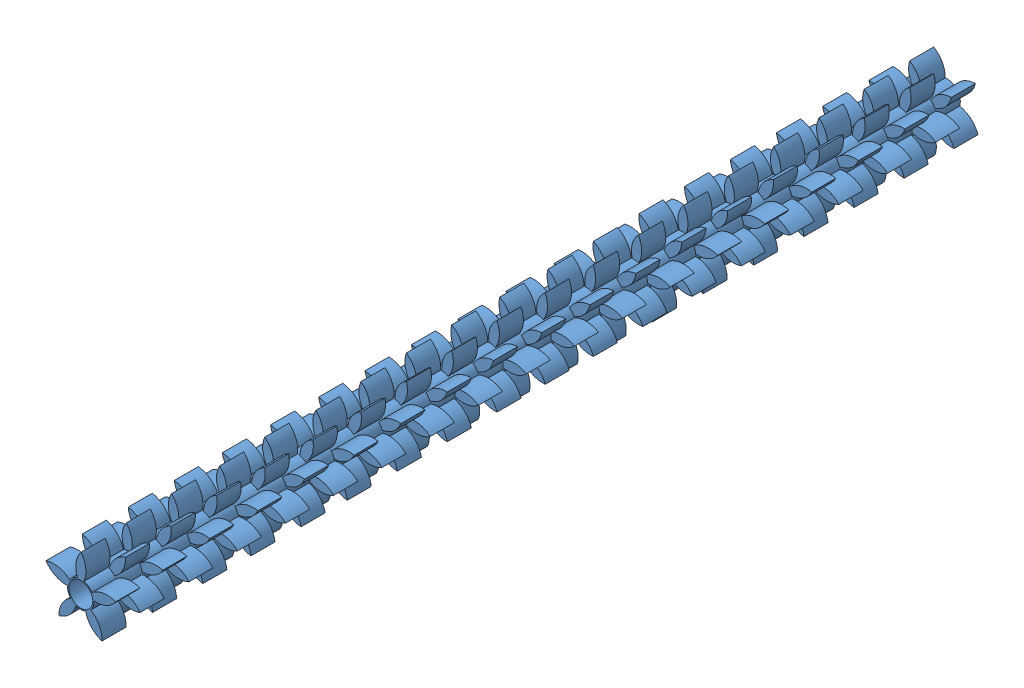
SolidWorks assembly spinner string.SLDASM, configuration Default (file format 9000). Lengths in mm.
Overall size (106.74 105.96 914.4).
36 component instances, 1 part files, 105 mates.
Components (placement in the parent):
- teeth-1: teeth.SLDPRT [Default] at (33.8751 48.8537 46.0127) size (73.59 70.22 25.4)
- teeth-2: teeth.SLDPRT [Default] at (33.8751 48.8537 -715.9873) x (0.689096 0.72467 0) z (0 0 1) size (73.59 70.22 25.4)
- teeth-3: teeth.SLDPRT [Default] at (33.8751 48.8537 -588.9873) x (0.328355 0.944554 0) z (0 0 1) size (73.59 70.22 25.4)
- teeth-4: teeth.SLDPRT [Default] at (33.8751 48.8537 20.6127) x (0.784538 0.620081 0) z (0 0 1) size (73.59 70.22 25.4)
- teeth-5: teeth.SLDPRT [Default] at (33.8751 48.8537 -385.7873) x (0.476503 0.879173 0) z (0 0 1) size (73.59 70.22 25.4)
- teeth-6: teeth.SLDPRT [Default] at (33.8751 48.8537 -411.1873) x (0.658961 -0.752177 0) z (0 0 1) size (73.59 70.22 25.4)
- teeth-7: teeth.SLDPRT [Default] at (33.8751 48.8537 -182.5873) x (0.910758 -0.41294 0) z (0 0 1) size (73.59 70.22 25.4)
- teeth-8: teeth.SLDPRT [Default] at (33.8751 48.8537 -157.1873) x (0.070933 0.997481 0) z (0 0 1) size (73.59 70.22 25.4)
- teeth-9: teeth.SLDPRT [Default] at (33.8751 48.8537 -106.3873) x (0.986889 0.161402 0) z (0 0 1) size (73.59 70.22 25.4)
- teeth-10: teeth.SLDPRT [Default] at (33.8751 48.8537 -55.5873) x (0.458468 -0.888711 0) z (0 0 1) size (73.59 70.22 25.4)
- teeth-11: teeth.SLDPRT [Default] at (33.8751 48.8537 -80.9873) x (0.910758 -0.41294 0) z (0 0 1) size (73.59 70.22 25.4)
- teeth-12: teeth.SLDPRT [Default] at (33.8751 48.8537 -487.3873) x (0.476503 0.879173 0) z (0 0 1) size (73.59 70.22 25.4)
- teeth-13: teeth.SLDPRT [Default] at (33.8751 48.8537 -639.7873) x (0.250799 0.968039 0) z (0 0 1) size (73.59 70.22 25.4)
- teeth-14: teeth.SLDPRT [Default] at (33.8751 48.8537 -538.1873) x (0.403754 0.914867 0) z (0 0 1) size (73.59 70.22 25.4)
- teeth-15: teeth.SLDPRT [Default] at (33.8751 48.8537 -461.9873) x (0.658961 -0.752177 0) z (0 0 1) size (73.59 70.22 25.4)
- teeth-16: teeth.SLDPRT [Default] at (33.8751 48.8537 -4.7873) x (0.996717 0.080967 0) z (0 0 1) size (73.59 70.22 25.4)
- teeth-17: teeth.SLDPRT [Default] at (33.8751 48.8537 -131.7873) x (0.674169 0.738577 0) z (0 0 1) size (73.59 70.22 25.4)
- teeth-18: teeth.SLDPRT [Default] at (33.8751 48.8537 -614.3873) x (0.797024 0.603947 0) z (0 0 1) size (73.59 70.22 25.4)
- teeth-19: teeth.SLDPRT [Default] at (33.8751 48.8537 -30.1873) x (0.874334 -0.485325 0) z (0 0 1) size (73.59 70.22 25.4)
- teeth-20: teeth.SLDPRT [Default] at (33.8751 48.8537 -817.5873) x (0.563098 0.82639 0) z (0 0 1) size (73.59 70.22 25.4)
- teeth-21: teeth.SLDPRT [Default] at (33.8751 48.8537 -842.9873) x (0.926845 0.375444 0) z (0 0 1) size (73.59 70.22 25.4)
- teeth-22: teeth.SLDPRT [Default] at (33.8751 48.8537 -563.5873) x (0.843307 0.537432 0) z (0 0 1) size (73.59 70.22 25.4)
- teeth-23: teeth.SLDPRT [Default] at (33.8751 48.8537 -665.1873) x (0.745508 0.666497 0) z (0 0 1) size (73.59 70.22 25.4)
- teeth-24: teeth.SLDPRT [Default] at (33.8751 48.8537 -741.3873) x (0.97529 0.220927 0) z (0 0 1) size (73.59 70.22 25.4)
- teeth-25: teeth.SLDPRT [Default] at (33.8751 48.8537 -792.1873) x (0.954201 0.299168 0) z (0 0 1) size (73.59 70.22 25.4)
- teeth-26: teeth.SLDPRT [Default] at (33.8751 48.8537 -766.7873) x (0.628159 0.778085 0) z (0 0 1) size (73.59 70.22 25.4)
- teeth-27: teeth.SLDPRT [Default] at (33.8751 48.8537 -690.5873) x (0.989976 0.141235 0) z (0 0 1) size (73.59 70.22 25.4)
- teeth-28: teeth.SLDPRT [Default] at (33.8751 48.8537 -512.7873) x (0.884053 0.467387 0) z (0 0 1) size (73.59 70.22 25.4)
- teeth-29: teeth.SLDPRT [Default] at (33.8751 48.8537 -360.3873) x (0.918993 0.394274 0) z (0 0 1) size (73.59 70.22 25.4)
- teeth-30: teeth.SLDPRT [Default] at (33.8751 48.8537 -436.5873) x (0.476503 0.879173 0) z (0 0 1) size (73.59 70.22 25.4)
- teeth-31: teeth.SLDPRT [Default] at (33.8751 48.8537 -334.9873) x (0.546122 0.837706 0) z (0 0 1) size (73.59 70.22 25.4)
- teeth-32: teeth.SLDPRT [Default] at (33.8751 48.8537 -309.5873) x (-0.579615 -0.814891 0) z (0 0 1) size (73.59 70.22 25.4)
- teeth-33: teeth.SLDPRT [Default] at (33.8751 48.8537 -284.1873) x (0.612155 0.790738 0) z (0 0 1) size (73.59 70.22 25.4)
- teeth-34: teeth.SLDPRT [Default] at (33.8751 48.8537 -233.3873) x (0.674169 0.738577 0) z (0 0 1) size (73.59 70.22 25.4)
- teeth-35: teeth.SLDPRT [Default] at (33.8751 48.8537 -207.9873) x (0.986889 0.161402 0) z (0 0 1) size (73.59 70.22 25.4)
- teeth-36: teeth.SLDPRT [Default] at (33.8751 48.8537 -258.7873) x (0.97058 0.240777 0) z (0 0 1) size (73.59 70.22 25.4)
Mates (geometry in assembly coordinates):
- Concentric2: concentric aligned: cylinder of teeth-1 through (33.8751 48.8537 71.4127) axis (0 0 -1) radius 12.7; cylinder of teeth-4 through (33.8751 48.8537 46.0127) axis (0 0 -1) radius 12.7
- Coincident1: coincident anti-aligned: plane of teeth-1 through (34.0112 72.0113 46.0127) normal (0 0 -1); plane of teeth-4 through (19.6223 67.1061 46.0127) normal (0 0 1)
- Concentric3: concentric aligned: cylinder of teeth-1 through (33.8751 48.8537 71.4127) axis (0 0 -1) radius 12.7; cylinder of teeth-16 through (33.8751 48.8537 20.6127) axis (0 0 -1) radius 12.7
- Coincident2: coincident anti-aligned: plane of teeth-4 through (19.6223 67.1061 20.6127) normal (0 0 -1); plane of teeth-16 through (32.1358 71.9463 20.6127) normal (0 0 1)
- Concentric4: concentric aligned: cylinder of teeth-1 through (33.8751 48.8537 71.4127) axis (0 0 -1) radius 12.7; cylinder of teeth-19 through (33.8751 48.8537 -4.7873) axis (0 0 -1) radius 12.7
- Coincident3: coincident anti-aligned: plane of teeth-16 through (32.1358 71.9463 -4.7873) normal (0 0 -1); plane of teeth-19 through (45.2331 69.0351 -4.7873) normal (0 0 1)
- Concentric6: concentric aligned: cylinder of teeth-1 through (33.8751 48.8537 71.4127) axis (0 0 -1) radius 12.7; cylinder of teeth-10 through (33.8751 48.8537 -30.1873) axis (0 0 -1) radius 12.7
- Coincident4: coincident anti-aligned: plane of teeth-10 through (54.5179 59.3498 -30.1873) normal (0 0 1); plane of teeth-19 through (45.2331 69.0351 -30.1873) normal (0 0 -1)
- Concentric7: concentric aligned: cylinder of teeth-1 through (33.8751 48.8537 71.4127) axis (0 0 -1) radius 12.7; cylinder of teeth-11 through (33.8751 48.8537 -55.5873) axis (0 0 -1) radius 12.7
- Coincident5: coincident anti-aligned: plane of teeth-10 through (54.5179 59.3498 -55.5873) normal (0 0 -1); plane of teeth-11 through (45.9494 68.6149 -55.5873) normal (0 0 1)
- Concentric8: concentric aligned: cylinder of teeth-1 through (33.8751 48.8537 71.4127) axis (0 0 -1) radius 12.7; cylinder of teeth-9 through (33.8751 48.8537 -80.9873) axis (0 0 -1) radius 12.7
- Coincident7: coincident anti-aligned: plane of teeth-9 through (32.9649 71.9938 -80.9873) normal (0 0 1); plane of teeth-11 through (45.9494 68.6149 -80.9873) normal (0 0 -1)
- Concentric9: concentric aligned: cylinder of teeth-1 through (33.8751 48.8537 71.4127) axis (0 0 -1) radius 12.7; cylinder of teeth-17 through (33.8751 48.8537 -106.3873) axis (0 0 -1) radius 12.7
- Coincident8: coincident anti-aligned: plane of teeth-9 through (32.9649 71.9938 -106.3873) normal (0 0 -1); plane of teeth-17 through (18.8123 66.4436 -106.3873) normal (0 0 1)
- Concentric10: concentric aligned: cylinder of teeth-1 through (33.8751 48.8537 71.4127) axis (0 0 -1) radius 12.7; cylinder of teeth-8 through (33.8751 48.8537 -131.7873) axis (0 0 -1) radius 12.7
- Coincident9: coincident anti-aligned: plane of teeth-8 through (11.1506 53.3135 -131.7873) normal (0 0 1); plane of teeth-17 through (18.8123 66.4436 -131.7873) normal (0 0 -1)
- Concentric11: concentric aligned: cylinder of teeth-1 through (33.8751 48.8537 71.4127) axis (0 0 -1) radius 12.7; cylinder of teeth-7 through (33.8751 48.8537 -157.1873) axis (0 0 -1) radius 12.7
- Coincident10: coincident anti-aligned: plane of teeth-7 through (45.9494 68.6149 -157.1873) normal (0 0 1); plane of teeth-8 through (11.1506 53.3135 -157.1873) normal (0 0 -1)
- Concentric12: concentric aligned: cylinder of teeth-1 through (33.8751 48.8537 71.4127) axis (0 0 -1) radius 12.7; cylinder of teeth-35 through (33.8751 48.8537 -182.5873) axis (0 0 -1) radius 12.7
- Coincident11: coincident anti-aligned: plane of teeth-7 through (45.9494 68.6149 -182.5873) normal (0 0 -1); plane of teeth-35 through (32.9649 71.9938 -182.5873) normal (0 0 1)
- Concentric13: concentric aligned: cylinder of teeth-1 through (33.8751 48.8537 71.4127) axis (0 0 -1) radius 12.7; cylinder of teeth-34 through (33.8751 48.8537 -207.9873) axis (0 0 -1) radius 12.7
- Coincident13: coincident anti-aligned: plane of teeth-34 through (18.8123 66.4436 -207.9873) normal (0 0 1); plane of teeth-35 through (32.9649 71.9938 -207.9873) normal (0 0 -1)
- Concentric14: concentric aligned: cylinder of teeth-1 through (33.8751 48.8537 71.4127) axis (0 0 -1) radius 12.7; cylinder of teeth-36 through (33.8751 48.8537 -233.3873) axis (0 0 -1) radius 12.7
- Coincident14: coincident anti-aligned: plane of teeth-34 through (18.8123 66.4436 -233.3873) normal (0 0 -1); plane of teeth-36 through (31.0943 71.8442 -233.3873) normal (0 0 1)
- Concentric15: concentric aligned: cylinder of teeth-1 through (33.8751 48.8537 71.4127) axis (0 0 -1) radius 12.7; cylinder of teeth-33 through (33.8751 48.8537 -258.7873) axis (0 0 -1) radius 12.7
- Coincident15: coincident anti-aligned: plane of teeth-33 through (17.4375 65.1663 -258.7873) normal (0 0 1); plane of teeth-36 through (31.0943 71.8442 -258.7873) normal (0 0 -1)
- Concentric16: concentric aligned: cylinder of teeth-1 through (33.8751 48.8537 71.4127) axis (0 0 -1) radius 12.7; cylinder of teeth-32 through (33.8751 48.8537 -284.1873) axis (0 0 -1) radius 12.7
- Coincident16: coincident anti-aligned: plane of teeth-32 through (50.9601 33.2206 -284.1873) normal (0 0 1); plane of teeth-33 through (17.4375 65.1663 -284.1873) normal (0 0 -1)
- Concentric17: concentric aligned: cylinder of teeth-1 through (33.8751 48.8537 71.4127) axis (0 0 -1) radius 12.7; cylinder of teeth-31 through (33.8751 48.8537 -309.5873) axis (0 0 -1) radius 12.7
- Coincident17: coincident anti-aligned: plane of teeth-31 through (16.1707 63.7818 -309.5873) normal (0 0 1); plane of teeth-32 through (50.9601 33.2206 -309.5873) normal (0 0 -1)
- Concentric18: concentric aligned: cylinder of teeth-1 through (33.8751 48.8537 71.4127) axis (0 0 -1) radius 12.7; cylinder of teeth-29 through (33.8751 48.8537 -334.9873) axis (0 0 -1) radius 12.7
- Coincident18: coincident anti-aligned: plane of teeth-29 through (27.4201 71.0939 -334.9873) normal (0 0 1); plane of teeth-31 through (16.1707 63.7818 -334.9873) normal (0 0 -1)
- Concentric19: concentric aligned: cylinder of teeth-1 through (33.8751 48.8537 71.4127) axis (0 0 -1) radius 12.7; cylinder of teeth-5 through (33.8751 48.8537 -360.3873) axis (0 0 -1) radius 12.7
- Coincident19: coincident anti-aligned: plane of teeth-5 through (15.0202 62.2993 -360.3873) normal (0 0 1); plane of teeth-29 through (27.4201 71.0939 -360.3873) normal (0 0 -1)
- Concentric20: concentric aligned: cylinder of teeth-1 through (33.8751 48.8537 71.4127) axis (0 0 -1) radius 12.7; cylinder of teeth-6 through (33.8751 48.8537 -385.7873) axis (0 0 -1) radius 12.7
- Coincident20: coincident anti-aligned: plane of teeth-5 through (15.0202 62.2993 -385.7873) normal (0 0 -1); plane of teeth-6 through (53.032 61.8654 -385.7873) normal (0 0 1)
- Concentric21: concentric aligned: cylinder of teeth-1 through (33.8751 48.8537 71.4127) axis (0 0 -1) radius 12.7; cylinder of teeth-30 through (33.8751 48.8537 -411.1873) axis (0 0 -1) radius 12.7
- Coincident21: coincident anti-aligned: plane of teeth-6 through (53.032 61.8654 -411.1873) normal (0 0 -1); plane of teeth-30 through (15.0202 62.2993 -411.1873) normal (0 0 1)
- Concentric22: concentric aligned: cylinder of teeth-1 through (33.8751 48.8537 71.4127) axis (0 0 -1) radius 12.7; cylinder of teeth-15 through (33.8751 48.8537 -436.5873) axis (0 0 -1) radius 12.7
- Coincident22: coincident anti-aligned: plane of teeth-15 through (53.032 61.8654 -436.5873) normal (0 0 1); plane of teeth-30 through (15.0202 62.2993 -436.5873) normal (0 0 -1)
- Concentric23: concentric aligned: cylinder of teeth-1 through (33.8751 48.8537 71.4127) axis (0 0 -1) radius 12.7; cylinder of teeth-12 through (33.8751 48.8537 -461.9873) axis (0 0 -1) radius 12.7
- Coincident23: coincident anti-aligned: plane of teeth-12 through (15.0202 62.2993 -461.9873) normal (0 0 1); plane of teeth-15 through (53.032 61.8654 -461.9873) normal (0 0 -1)
- Concentric24: concentric aligned: cylinder of teeth-1 through (33.8751 48.8537 71.4127) axis (0 0 -1) radius 12.7; cylinder of teeth-28 through (33.8751 48.8537 -487.3873) axis (0 0 -1) radius 12.7
- Coincident24: coincident anti-aligned: plane of teeth-12 through (15.0202 62.2993 -487.3873) normal (0 0 -1); plane of teeth-28 through (25.6405 70.4982 -487.3873) normal (0 0 1)
- Concentric25: concentric aligned: cylinder of teeth-1 through (33.8751 48.8537 71.4127) axis (0 0 -1) radius 12.7; cylinder of teeth-14 through (33.8751 48.8537 -512.7873) axis (0 0 -1) radius 12.7
- Coincident25: coincident anti-aligned: plane of teeth-14 through (13.9934 60.7286 -512.7873) normal (0 0 1); plane of teeth-28 through (25.6405 70.4982 -512.7873) normal (0 0 -1)
- Concentric26: concentric aligned: cylinder of teeth-1 through (33.8751 48.8537 71.4127) axis (0 0 -1) radius 12.7; cylinder of teeth-22 through (33.8751 48.8537 -538.1873) axis (0 0 -1) radius 12.7
- Coincident26: coincident anti-aligned: plane of teeth-14 through (13.9934 60.7286 -538.1873) normal (0 0 -1); plane of teeth-22 through (23.9151 69.7605 -538.1873) normal (0 0 1)
- Concentric27: concentric aligned: cylinder of teeth-1 through (33.8751 48.8537 71.4127) axis (0 0 -1) radius 12.7; cylinder of teeth-3 through (33.8751 48.8537 -563.5873) axis (0 0 -1) radius 12.7
- Coincident27: coincident anti-aligned: plane of teeth-3 through (13.0972 59.0798 -563.5873) normal (0 0 1); plane of teeth-22 through (23.9151 69.7605 -563.5873) normal (0 0 -1)
- Concentric28: concentric aligned: cylinder of teeth-1 through (33.8751 48.8537 71.4127) axis (0 0 -1) radius 12.7; cylinder of teeth-18 through (33.8751 48.8537 -588.9873) axis (0 0 -1) radius 12.7
- Coincident29: coincident anti-aligned: plane of teeth-3 through (13.0972 59.0798 -588.9873) normal (0 0 -1); plane of teeth-18 through (22.255 68.8854 -588.9873) normal (0 0 1)
- Concentric29: concentric aligned: cylinder of teeth-1 through (33.8751 48.8537 71.4127) axis (0 0 -1) radius 12.7; cylinder of teeth-13 through (33.8751 48.8537 -614.3873) axis (0 0 -1) radius 12.7
- Coincident30: coincident anti-aligned: plane of teeth-13 through (12.3375 57.3639 -614.3873) normal (0 0 1); plane of teeth-18 through (22.255 68.8854 -614.3873) normal (0 0 -1)
- Concentric30: concentric aligned: cylinder of teeth-1 through (33.8751 48.8537 71.4127) axis (0 0 -1) radius 12.7; cylinder of teeth-23 through (33.8751 48.8537 -639.7873) axis (0 0 -1) radius 12.7
- Coincident31: coincident anti-aligned: plane of teeth-13 through (12.3375 57.3639 -639.7873) normal (0 0 -1); plane of teeth-23 through (20.6713 67.8788 -639.7873) normal (0 0 1)
- Concentric31: concentric aligned: cylinder of teeth-1 through (33.8751 48.8537 71.4127) axis (0 0 -1) radius 12.7; cylinder of teeth-27 through (33.8751 48.8537 -665.1873) axis (0 0 -1) radius 12.7
- Coincident32: coincident anti-aligned: plane of teeth-23 through (20.6713 67.8788 -665.1873) normal (0 0 -1); plane of teeth-27 through (33.4372 72.0076 -665.1873) normal (0 0 1)
- Concentric32: concentric aligned: cylinder of teeth-1 through (33.8751 48.8537 71.4127) axis (0 0 -1) radius 12.7; cylinder of teeth-2 through (33.8751 48.8537 -690.5873) axis (0 0 -1) radius 12.7
- Coincident33: coincident anti-aligned: plane of teeth-2 through (19.1743 66.7472 -690.5873) normal (0 0 1); plane of teeth-27 through (33.4372 72.0076 -690.5873) normal (0 0 -1)
- Concentric33: concentric aligned: cylinder of teeth-1 through (33.8751 48.8537 71.4127) axis (0 0 -1) radius 12.7; cylinder of teeth-24 through (33.8751 48.8537 -715.9873) axis (0 0 -1) radius 12.7
- Coincident36: coincident anti-aligned: plane of teeth-2 through (19.1743 66.7472 -715.9873) normal (0 0 -1); plane of teeth-24 through (31.5639 71.8961 -715.9873) normal (0 0 1)
- Concentric34: concentric aligned: cylinder of teeth-1 through (33.8751 48.8537 71.4127) axis (0 0 -1) radius 12.7; cylinder of teeth-26 through (33.8751 48.8537 -741.3873) axis (0 0 -1) radius 12.7
- Coincident37: coincident anti-aligned: plane of teeth-24 through (31.5639 71.8961 -741.3873) normal (0 0 -1); plane of teeth-26 through (17.7737 65.4982 -741.3873) normal (0 0 1)
- Concentric35: concentric aligned: cylinder of teeth-1 through (33.8751 48.8537 71.4127) axis (0 0 -1) radius 12.7; cylinder of teeth-25 through (33.8751 48.8537 -766.7873) axis (0 0 -1) radius 12.7
- Coincident38: coincident anti-aligned: plane of teeth-25 through (29.7058 71.6333 -766.7873) normal (0 0 1); plane of teeth-26 through (17.7737 65.4982 -766.7873) normal (0 0 -1)
- Concentric36: concentric aligned: cylinder of teeth-1 through (33.8751 48.8537 71.4127) axis (0 0 -1) radius 12.7; cylinder of teeth-20 through (33.8751 48.8537 -792.1873) axis (0 0 -1) radius 12.7
- Coincident39: coincident anti-aligned: plane of teeth-20 through (16.479 64.1399 -792.1873) normal (0 0 1); plane of teeth-25 through (29.7058 71.6333 -792.1873) normal (0 0 -1)
- Concentric37: concentric aligned: cylinder of teeth-1 through (33.8751 48.8537 71.4127) axis (0 0 -1) radius 12.7; cylinder of teeth-21 through (33.8751 48.8537 -817.5873) axis (0 0 -1) radius 12.7
- Coincident40: coincident anti-aligned: plane of teeth-20 through (16.479 64.1399 -817.5873) normal (0 0 -1); plane of teeth-21 through (27.8751 71.221 -817.5873) normal (0 0 1)
- Distance1: distance = 25.4 mm aligned: line of teeth-4 through (55.6577 80.833 46.0127) axis (0 0 -1); line of teeth-1 through (70.7941 60.4357 71.4127) axis (0 0 -1)
- Distance2: distance = 25.4 mm: line of teeth-19 through (7.7925 77.4343 -4.7873) axis (0 0 -1); line of teeth-16 through (31.1346 87.4496 20.6127) axis (0 0 -1)
- Distance4: distance = 25.4 mm: line of teeth-16 through (31.1346 87.4496 20.6127) axis (0 0 -1); line of teeth-4 through (55.6577 80.833 46.0127) axis (0 0 -1)
- Distance5: distance = 25.4 mm: line of teeth-10 through (28.0186 87.101 -30.1873) axis (0 0 -1); line of teeth-19 through (52.9969 82.4917 -4.7873) axis (0 0 -1)
- Distance6: distance = 25.4 mm: line of teeth-11 through (5.5641 75.2287 -55.5873) axis (0 0 -1); line of teeth-9 through (28.0186 87.101 -80.9873) axis (0 0 -1)
- Distance7: distance = 25.4 mm: line of teeth-9 through (-4.31 55.103 -80.9873) axis (0 0 -1); line of teeth-17 through (0.0425 30.0786 -106.3873) axis (0 0 -1)
- Distance8: distance = 25.4 mm: line of teeth-17 through (5.5641 75.2287 -106.3873) axis (0 0 -1); line of teeth-8 through (-4.6906 51.9907 -131.7873) axis (0 0 -1)
- Distance9: distance = 25.4 mm: line of teeth-7 through (50.2106 83.9295 -157.1873) axis (0 0 -1); line of teeth-8 through (24.9411 86.5013 -131.7873) axis (0 0 -1)
- Distance10: distance = 25.4 mm: line of teeth-7 through (5.5641 75.2287 -157.1873) axis (0 0 -1); line of teeth-35 through (28.0186 87.101 -182.5873) axis (0 0 -1)
- Distance11: distance = 25.4 mm: line of teeth-34 through (0.0425 30.0786 -207.9873) axis (0 0 -1); line of teeth-35 through (-4.31 55.103 -182.5873) axis (0 0 -1)
- Distance12: distance = 25.4 mm: line of teeth-34 through (5.5641 75.2287 -207.9873) axis (0 0 -1); line of teeth-36 through (-4.6906 51.9907 -233.3873) axis (0 0 -1)
- Distance13: distance = 25.4 mm: line of teeth-36 through (-4.6906 51.9907 -233.3873) axis (0 0 -1); line of teeth-33 through (1.6737 27.401 -258.7873) axis (0 0 -1)
- Distance14: distance = 25.4 mm: line of teeth-32 through (-4.8179 48.8579 -284.1873) axis (0 0 -1); line of teeth-33 through (3.5215 72.8498 -258.7873) axis (0 0 -1)
- Distance15: distance = 25.4 mm: line of teeth-31 through (1.6783 70.3134 -309.5873) axis (0 0 -1); line of teeth-32 through (21.9222 85.6543 -284.1873) axis (0 0 -1)
- Distance16: distance = 25.4 mm: line of teeth-31 through (44.3351 86.1061 -309.5873) axis (0 0 -1); line of teeth-29 through (18.9818 84.5657 -334.9873) axis (0 0 -1)
- Distance17: distance = 25.4 mm: line of teeth-29 through (18.9818 84.5657 -334.9873) axis (0 0 -1); line of teeth-5 through (0.0465 67.6361 -360.3873) axis (0 0 -1)
- Distance18: distance = 25.4 mm: line of teeth-5 through (41.2845 86.8307 -360.3873) axis (0 0 -1); line of teeth-6 through (63.2369 74.0537 -385.7873) axis (0 0 -1)
- Distance19: distance = 25.4 mm: line of teeth-6 through (18.9818 84.5657 -385.7873) axis (0 0 -1); line of teeth-30 through (0.0465 67.6361 -411.1873) axis (0 0 -1)
- Distance20: distance = 25.4 mm: line of teeth-15 through (18.9818 84.5657 -436.5873) axis (0 0 -1); line of teeth-30 through (0.0465 67.6361 -411.1873) axis (0 0 -1)
- Distance21: distance = 25.4 mm: line of teeth-15 through (18.9818 84.5657 -436.5873) axis (0 0 -1); line of teeth-12 through (0.0465 67.6361 -461.9873) axis (0 0 -1)
- Distance22: distance = 25.4 mm: line of teeth-28 through (-4.3113 42.6127 -487.3873) axis (0 0 -1); line of teeth-12 through (0.0465 67.6361 -461.9873) axis (0 0 -1)
- Distance23: distance = 25.4 mm: line of teeth-28 through (16.1393 83.2426 -487.3873) axis (0 0 -1); line of teeth-14 through (-1.3632 64.8354 -512.7873) axis (0 0 -1)
- Distance24: distance = 25.4 mm: line of teeth-14 through (-1.3632 64.8354 -512.7873) axis (0 0 -1); line of teeth-22 through (-3.6806 39.5413 -538.1873) axis (0 0 -1)
- Distance25: distance = 25.4 mm: line of teeth-22 through (13.4131 81.6937 -538.1873) axis (0 0 -1); line of teeth-3 through (-2.5415 61.9298 -563.5873) axis (0 0 -1)
- Distance26: distance = 25.4 mm: line of teeth-3 through (35.0578 87.5287 -563.5873) axis (0 0 -1); line of teeth-18 through (10.8214 79.9291 -588.9873) axis (0 0 -1)
- Distance27: distance = 25.4 mm: line of teeth-18 through (10.8214 79.9291 -588.9873) axis (0 0 -1); line of teeth-13 through (-3.4807 58.9383 -614.3873) axis (0 0 -1)
- Distance28: distance = 25.4 mm: line of teeth-13 through (31.9226 87.4975 -614.3873) axis (0 0 -1); line of teeth-23 through (8.381 77.9605 -639.7873) axis (0 0 -1)
- Distance29: distance = 25.4 mm: line of teeth-23 through (8.381 77.9605 -639.7873) axis (0 0 -1); line of teeth-27 through (-4.1745 55.8807 -665.1873) axis (0 0 -1)
- Distance30: distance = 25.4 mm: line of teeth-27 through (28.8001 87.2125 -665.1873) axis (0 0 -1); line of teeth-2 through (6.108 75.8007 -690.5873) axis (0 0 -1)
- Distance31: distance = 25.4 mm: line of teeth-2 through (6.108 75.8007 -690.5873) axis (0 0 -1); line of teeth-24 through (-4.6185 52.7768 -715.9873) axis (0 0 -1)
- Distance32: distance = 25.4 mm: line of teeth-24 through (25.711 86.6757 -715.9873) axis (0 0 -1); line of teeth-26 through (4.0174 73.4641 -741.3873) axis (0 0 -1)
- Distance33: distance = 25.4 mm: line of teeth-26 through (4.0174 73.4641 -741.3873) axis (0 0 -1); line of teeth-25 through (-4.8098 49.6472 -766.7873) axis (0 0 -1)
- Distance34: distance = 25.4 mm: line of teeth-25 through (22.6755 85.8905 -766.7873) axis (0 0 -1); line of teeth-20 through (2.1228 70.9658 -792.1873) axis (0 0 -1)
- Distance35: distance = 25.4 mm: line of teeth-20 through (2.1228 70.9658 -792.1873) axis (0 0 -1); line of teeth-21 through (-4.747 46.5124 -817.5873) axis (0 0 -1)
- Distance36: distance = 25.4 mm: line of teeth-10 through (68.4407 66.2426 -30.1873) axis (0 0 -1); line of teeth-11 through (50.2106 83.9295 -55.5873) axis (0 0 -1)
